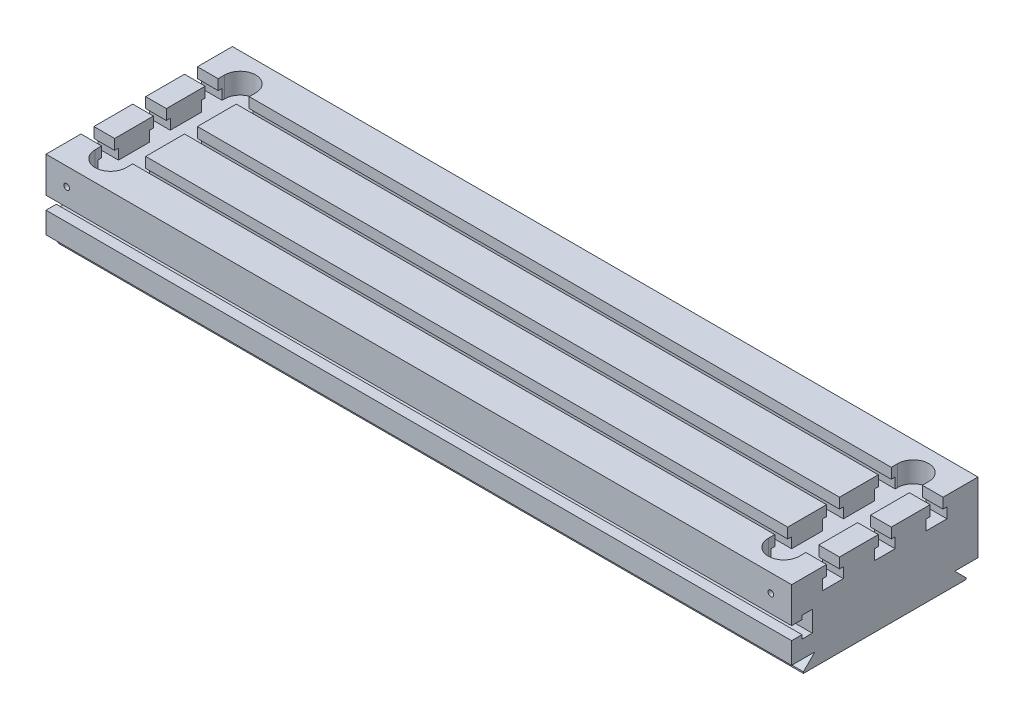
from build123d import *
from OCP.BRepFilletAPI import BRepFilletAPI_MakeChamfer

# Parameters (mm, degrees)
SKETCH1_W                      = 914.4
SKETCH1_H                      = 228.6
EXTRUDE1_DEPTH                 = 85.725
CUT_EXTRUDE1_DEPTH             = 480.004285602
LPATTERN1_COUNT                = 2
LPATTERN1_PITCH                = 63.5
LPATTERN1_COL_COUNT            = 2
LPATTERN1_COL_PITCH            = 63.5
CUT_EXTRUDE2_DEPTH             = 480.004285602
CUT_EXTRUDE2_DEPTH_BACK        = 480.004285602
EXTRUDE2_DEPTH                 = 457.2
EXTRUDE2_DEPTH_BACK            = 457.2
CHAMFER1_SIZE                  = 2.54
CHAMFER1_SIZE2                 = 1.796051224
CUT_EXTRUDE3_REACH             = 484.098
M8X1_0_TAPPED_HOLE1_AT_2_COUNT = 2
M8X1_0_TAPPED_HOLE1_AT_2_PITCH = 863.6


with BuildPart() as part:
    # Sketch1 → Extrude1 (new body)
    with BuildSketch(Plane(origin=(0, 0, 0), x_dir=(1, 0, 0), z_dir=(0, 1, 0))):
        Rectangle(SKETCH1_W, SKETCH1_H)
    extrude(amount=-EXTRUDE1_DEPTH)

    # Sketch2 → Cut-Extrude1 (cut, symmetric)
    with BuildSketch(Plane(origin=(0, 0, 0), x_dir=(0, 0, -1), z_dir=(1, 0, 0))):
        Polygon((12.7, -25.4), (12.7, -12.7), (7.9375, -12.7), (7.9375, 0), (-7.9375, 0), (-7.9375, -12.7), (-12.7, -12.7), (-12.7, -25.4), align=None)
    cut_extrude1 = extrude(amount=CUT_EXTRUDE1_DEPTH, both=True, mode=Mode.SUBTRACT)

    # LPattern1: Cut-Extrude1 ×2
    with Locations(*[(0, 0, -i * LPATTERN1_PITCH) for i in range(1, LPATTERN1_COUNT)]):
        add(cut_extrude1, mode=Mode.SUBTRACT)

    # LPattern1 col: Cut-Extrude1 ×2
    with Locations(*[(0, 0, i * LPATTERN1_COL_PITCH) for i in range(1, LPATTERN1_COL_COUNT)]):
        add(cut_extrude1, mode=Mode.SUBTRACT)

    # Sketch3 → Cut-Extrude2 (cut, two sides: drawn at the far end of the back side and taken through both)
    with BuildSketch(Plane(origin=(0, 0, 0), x_dir=(0, 0, -1), z_dir=(1, 0, 0)).offset(-CUT_EXTRUDE2_DEPTH_BACK)):
        Polygon((-114.3, -59.51659036), (-101.6, -59.51659036), (-101.6, -64.27909036), (-88.9, -64.27909036), (-88.9, -38.87909036), (-101.6, -38.87909036), (-101.6, -43.64159036), (-114.3, -43.64159036), align=None)
    extrude(amount=CUT_EXTRUDE2_DEPTH + CUT_EXTRUDE2_DEPTH_BACK, mode=Mode.SUBTRACT)

    # Sketch4 → Extrude2 (add, two sides: drawn at the far end of the back side and taken through both)
    with BuildSketch(Plane(origin=(0, 0, 0), x_dir=(0, 0, -1), z_dir=(1, 0, 0)).offset(-EXTRUDE2_DEPTH_BACK)):
        Polygon((-85.725, -85.725), (-101.6, -101.6), (101.6, -101.6), (85.725, -85.725), align=None)
    extrude(amount=EXTRUDE2_DEPTH + EXTRUDE2_DEPTH_BACK)

    # Chamfer1: one chamfer whose edges measure the first distance from different faces: ONE call of the kernel's chamfer builder (chamfer() names one face for all edges)
    chamfer1_edges_1 = [part.edges().sort_by_distance(p)[0] for p in [
        (0, -101.6, -101.6),
    ]]
    chamfer1_side_1 = [part.faces().sort_by_distance(p)[0] for p in [
        (0, -101.6, 0),
    ]]
    chamfer1_edges_2 = [part.edges().sort_by_distance(p)[0] for p in [
        (0, -101.6, 101.6),
    ]]
    chamfer1_side_2 = [part.faces().sort_by_distance(p)[0] for p in [
        (0, -93.6625, 93.6625),
    ]]
    chamfer1 = BRepFilletAPI_MakeChamfer(part.part.solid().wrapped)
    for e in chamfer1_edges_1:
        chamfer1.Add(CHAMFER1_SIZE, CHAMFER1_SIZE2, e.wrapped, chamfer1_side_1[0].wrapped)  # the first distance lies on this face
    for e in chamfer1_edges_2:
        chamfer1.Add(CHAMFER1_SIZE, CHAMFER1_SIZE2, e.wrapped, chamfer1_side_2[0].wrapped)  # the first distance lies on this face
    add(Compound.cast(chamfer1.Shape()), mode=Mode.REPLACE)

    # Cut-Extrude3: up to this face of the body (flat: up to its plane)
    cut_extrude3_end = Plane(part.part.faces().sort_by_distance((0, -25.4, 63.5))[0])
    # Sketch5 → Cut-Extrude3 (cut, up to the picked face)
    with BuildSketch(Plane(origin=(0, 0, 0), x_dir=(-1, 0, 0), z_dir=(0, 1, 0)), mode=Mode.PRIVATE) as cut_extrude3_sk1:
        with BuildLine():
            Line((431.8, -79.375), (431.8, 79.375))
            ThreePointArc((431.8, 79.375), (412.75, 98.425), (393.7, 79.375))
            Line((393.7, 79.375), (393.7, -79.375))
            ThreePointArc((393.7, -79.375), (412.75, -98.425), (431.8, -79.375))
        make_face()
    cut_extrude3_tool1 = split(extrude(cut_extrude3_sk1.sketch, amount=-CUT_EXTRUDE3_REACH, mode=Mode.PRIVATE), bisect_by=cut_extrude3_end, keep=Keep.BOTH, mode=Mode.PRIVATE)
    cut_extrude3 = cut_extrude3_tool1.solids().sort_by(Axis((-412.75, 0, 0), (0, -1, 0)))[0]
    add(cut_extrude3, mode=Mode.SUBTRACT)

    # Mirror1: Cut-Extrude3 across plane
    add(cut_extrude3.mirror(Plane(origin=(0, 0, 0), x_dir=(0, 0, 1), z_dir=(1, 0, 0))), mode=Mode.SUBTRACT)

    # Sketch6 → M8x1.0 Tapped Hole1 (revolve, cut)
    with BuildSketch(Plane(origin=(431.8, -22, 114.3), x_dir=(0, -1, 0), z_dir=(1, 0, 0))):
        Polygon((0, 0), (0, 20.103001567), (3.5, 17.9999894), (3.5, 0), align=None)
    m8x1_0_tapped_hole1 = revolve(axis=Axis((431.8, -22, 120.65), (0, 0, -1)), mode=Mode.SUBTRACT)

    # M8x1.0 Tapped Hole1 at 2: M8x1.0 Tapped Hole1 ×2
    with Locations(*[(-i * M8X1_0_TAPPED_HOLE1_AT_2_PITCH, 0, 0) for i in range(1, M8X1_0_TAPPED_HOLE1_AT_2_COUNT)]):
        add(m8x1_0_tapped_hole1, mode=Mode.SUBTRACT)

    # Mirror2: M8x1.0 Tapped Hole1 across plane
    add(m8x1_0_tapped_hole1.mirror(Plane.XY), mode=Mode.SUBTRACT)

    # Mirror2 copy 1 sketch → Mirror2 copy 1 (revolve, cut)
    with BuildSketch(Plane(origin=(-431.8, -22, -114.3), x_dir=(0, -1, 0), z_dir=(1, 0, 0))):
        Polygon((0, 0), (0, -20.103001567), (3.5, -17.9999894), (3.5, 0), align=None)
    revolve(axis=Axis((-431.8, -22, -120.65), (0, 0, -1)), mode=Mode.SUBTRACT)


solid = part.part
